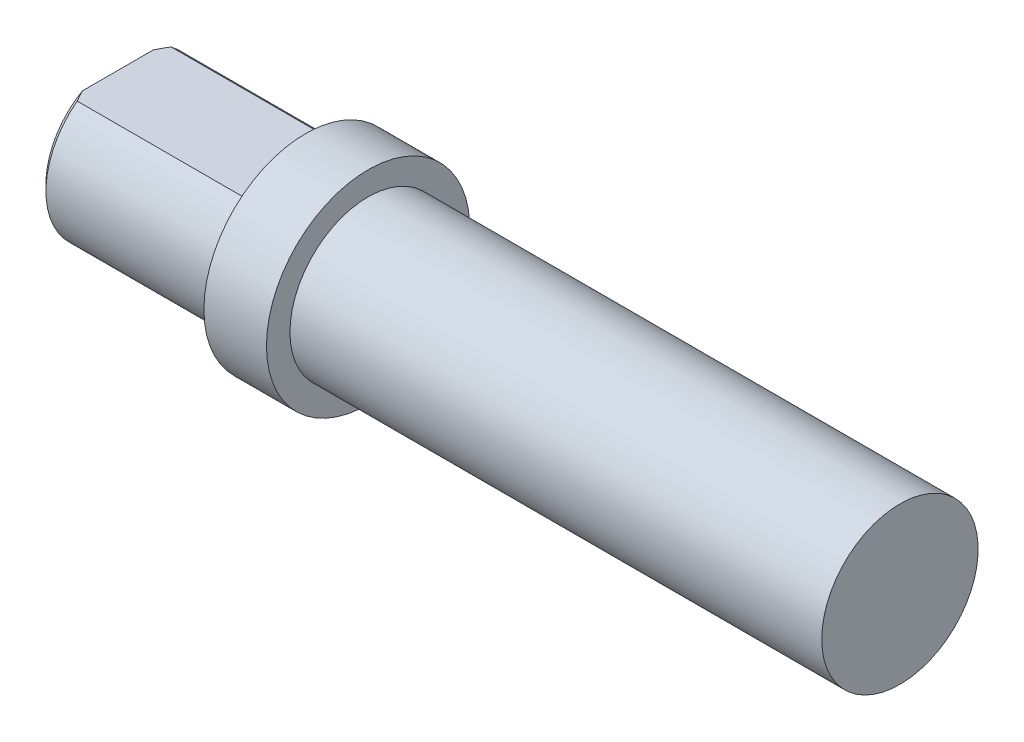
ISO-10303-21;
HEADER;
FILE_DESCRIPTION(('STEP AP214'),'2;1');
FILE_NAME('part.step','',(''),(''),'','','');
FILE_SCHEMA(('AUTOMOTIVE_DESIGN { 1 0 10303 214 1 1 1 1 }'));
ENDSEC;
DATA;
#1=APPLICATION_CONTEXT('core data for automotive mechanical design processes');
#2=APPLICATION_PROTOCOL_DEFINITION('international standard','automotive_design',2000,#1);
#3=PRODUCT_CONTEXT('',#1,'mechanical');
#4=PRODUCT('Part','Part','',(#3));
#5=PRODUCT_RELATED_PRODUCT_CATEGORY('part','',(#4));
#6=PRODUCT_DEFINITION_FORMATION('','',#4);
#7=PRODUCT_DEFINITION_CONTEXT('part definition',#1,'design');
#8=PRODUCT_DEFINITION('design','',#6,#7);
#9=PRODUCT_DEFINITION_SHAPE('','',#8);
#10=(LENGTH_UNIT() NAMED_UNIT(*) SI_UNIT(.MILLI.,.METRE.));
#11=(NAMED_UNIT(*) PLANE_ANGLE_UNIT() SI_UNIT($,.RADIAN.));
#12=(NAMED_UNIT(*) SI_UNIT($,.STERADIAN.) SOLID_ANGLE_UNIT());
#13=UNCERTAINTY_MEASURE_WITH_UNIT(LENGTH_MEASURE(1.E-05),#10,'distance_accuracy_value','');
#14=(GEOMETRIC_REPRESENTATION_CONTEXT(3) GLOBAL_UNCERTAINTY_ASSIGNED_CONTEXT((#13)) GLOBAL_UNIT_ASSIGNED_CONTEXT((#10,
#11,#12)) REPRESENTATION_CONTEXT('',''));
#15=CARTESIAN_POINT('',(0.,0.,0.));
#16=DIRECTION('',(0.,0.,1.));
#17=DIRECTION('',(1.,0.,0.));
#18=AXIS2_PLACEMENT_3D('',#15,#16,#17);
#19=CARTESIAN_POINT('',(0.,0.,0.));
#20=DIRECTION('',(-1.,0.,0.));
#21=DIRECTION('',(0.,0.,1.));
#22=AXIS2_PLACEMENT_3D('',#19,#20,#21);
#23=CYLINDRICAL_SURFACE('',#22,2.5);
#24=CARTESIAN_POINT('',(0.,0.,0.));
#25=DIRECTION('',(-1.,0.,0.));
#26=DIRECTION('',(0.,0.,1.));
#27=AXIS2_PLACEMENT_3D('',#24,#25,#26);
#28=CIRCLE('',#27,2.5);
#29=CARTESIAN_POINT('',(0.,0.,2.5));
#30=VERTEX_POINT('',#29);
#31=EDGE_CURVE('E78',#30,#30,#28,.T.);
#32=ORIENTED_EDGE('',*,*,#31,.T.);
#33=EDGE_LOOP('',(#32));
#34=FACE_BOUND('',#33,.T.);
#35=CARTESIAN_POINT('',(-17.,0.,0.));
#36=DIRECTION('',(-1.,0.,0.));
#37=DIRECTION('',(0.,0.,1.));
#38=AXIS2_PLACEMENT_3D('',#35,#36,#37);
#39=CIRCLE('',#38,2.5);
#40=CARTESIAN_POINT('',(-17.,0.,2.5));
#41=VERTEX_POINT('',#40);
#42=EDGE_CURVE('E83',#41,#41,#39,.T.);
#43=ORIENTED_EDGE('',*,*,#42,.F.);
#44=EDGE_LOOP('',(#43));
#45=FACE_BOUND('',#44,.T.);
#46=ADVANCED_FACE('F33',(#34,#45),#23,.T.);
#47=CARTESIAN_POINT('',(0.,0.,0.));
#48=DIRECTION('',(-1.,0.,0.));
#49=DIRECTION('',(0.,0.,1.));
#50=AXIS2_PLACEMENT_3D('',#47,#48,#49);
#51=PLANE('',#50);
#52=ORIENTED_EDGE('',*,*,#31,.F.);
#53=EDGE_LOOP('',(#52));
#54=FACE_BOUND('',#53,.T.);
#55=ADVANCED_FACE('F113',(#54),#51,.F.);
#56=CARTESIAN_POINT('',(-19.,0.,0.));
#57=DIRECTION('',(-1.,0.,0.));
#58=DIRECTION('',(0.,0.,1.));
#59=AXIS2_PLACEMENT_3D('',#56,#57,#58);
#60=PLANE('',#59);
#61=CARTESIAN_POINT('',(-19.,0.,0.));
#62=DIRECTION('',(-1.,0.,0.));
#63=DIRECTION('',(0.,0.,1.));
#64=AXIS2_PLACEMENT_3D('',#61,#62,#63);
#65=CIRCLE('',#64,3.25);
#66=CARTESIAN_POINT('',(-19.,0.,3.25));
#67=VERTEX_POINT('',#66);
#68=EDGE_CURVE('E72',#67,#67,#65,.T.);
#69=ORIENTED_EDGE('',*,*,#68,.T.);
#70=EDGE_LOOP('',(#69));
#71=FACE_BOUND('',#70,.T.);
#72=CARTESIAN_POINT('',(-19.,0.,0.));
#73=DIRECTION('',(-1.,0.,0.));
#74=DIRECTION('',(0.,0.,1.));
#75=AXIS2_PLACEMENT_3D('',#72,#73,#74);
#76=CIRCLE('',#75,2.5);
#77=CARTESIAN_POINT('',(-19.,2.,-1.5));
#78=VERTEX_POINT('',#77);
#79=CARTESIAN_POINT('',(-19.,2.,1.5));
#80=VERTEX_POINT('',#79);
#81=EDGE_CURVE('E48',#78,#80,#76,.T.);
#82=ORIENTED_EDGE('',*,*,#81,.F.);
#83=DIRECTION('',(0.,0.,-1.));
#84=VECTOR('',#83,1.);
#85=CARTESIAN_POINT('',(-19.,2.,0.));
#86=LINE('',#85,#84);
#87=EDGE_CURVE('E11',#80,#78,#86,.T.);
#88=ORIENTED_EDGE('',*,*,#87,.F.);
#89=EDGE_LOOP('',(#82,#88));
#90=FACE_BOUND('',#89,.T.);
#91=ADVANCED_FACE('F65',(#71,#90),#60,.T.);
#92=CARTESIAN_POINT('',(-17.,0.,0.));
#93=DIRECTION('',(-1.,0.,0.));
#94=DIRECTION('',(0.,0.,1.));
#95=AXIS2_PLACEMENT_3D('',#92,#93,#94);
#96=PLANE('',#95);
#97=CARTESIAN_POINT('',(-17.,0.,0.));
#98=DIRECTION('',(-1.,0.,0.));
#99=DIRECTION('',(0.,0.,1.));
#100=AXIS2_PLACEMENT_3D('',#97,#98,#99);
#101=CIRCLE('',#100,3.25);
#102=CARTESIAN_POINT('',(-17.,0.,3.25));
#103=VERTEX_POINT('',#102);
#104=EDGE_CURVE('E131',#103,#103,#101,.T.);
#105=ORIENTED_EDGE('',*,*,#104,.F.);
#106=EDGE_LOOP('',(#105));
#107=FACE_BOUND('',#106,.T.);
#108=ORIENTED_EDGE('',*,*,#42,.T.);
#109=EDGE_LOOP('',(#108));
#110=FACE_BOUND('',#109,.T.);
#111=ADVANCED_FACE('F120',(#107,#110),#96,.F.);
#112=CARTESIAN_POINT('',(-19.,0.,0.));
#113=DIRECTION('',(1.,0.,0.));
#114=DIRECTION('',(0.,0.,-1.));
#115=AXIS2_PLACEMENT_3D('',#112,#113,#114);
#116=CYLINDRICAL_SURFACE('',#115,3.25);
#117=ORIENTED_EDGE('',*,*,#68,.F.);
#118=EDGE_LOOP('',(#117));
#119=FACE_BOUND('',#118,.T.);
#120=ORIENTED_EDGE('',*,*,#104,.T.);
#121=EDGE_LOOP('',(#120));
#122=FACE_BOUND('',#121,.T.);
#123=ADVANCED_FACE('F105',(#119,#122),#116,.T.);
#124=CARTESIAN_POINT('',(-25.,2.5,0.));
#125=DIRECTION('',(1.,0.,0.));
#126=DIRECTION('',(0.,0.,-1.));
#127=AXIS2_PLACEMENT_3D('',#124,#125,#126);
#128=PLANE('',#127);
#129=DIRECTION('',(0.,0.,1.));
#130=VECTOR('',#129,1.);
#131=CARTESIAN_POINT('',(-25.,2.,0.));
#132=LINE('',#131,#130);
#133=CARTESIAN_POINT('',(-25.,2.,-1.13578166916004));
#134=VERTEX_POINT('',#133);
#135=CARTESIAN_POINT('',(-25.,2.,1.13578166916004));
#136=VERTEX_POINT('',#135);
#137=EDGE_CURVE('E71',#134,#136,#132,.T.);
#138=ORIENTED_EDGE('',*,*,#137,.F.);
#139=CARTESIAN_POINT('',(-25.,0.,0.));
#140=DIRECTION('',(1.,0.,0.));
#141=DIRECTION('',(0.,0.,-1.));
#142=AXIS2_PLACEMENT_3D('',#139,#140,#141);
#143=CIRCLE('',#142,2.29999999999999);
#144=EDGE_CURVE('E81',#134,#136,#143,.F.);
#145=ORIENTED_EDGE('',*,*,#144,.T.);
#146=EDGE_LOOP('',(#138,#145));
#147=FACE_BOUND('',#146,.T.);
#148=ADVANCED_FACE('F107',(#147),#128,.F.);
#149=CARTESIAN_POINT('',(-25.,0.,0.));
#150=DIRECTION('',(1.,0.,0.));
#151=DIRECTION('',(0.,0.,-1.));
#152=AXIS2_PLACEMENT_3D('',#149,#150,#151);
#153=CONICAL_SURFACE('',#152,2.29999999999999,0.785398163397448);
#154=CARTESIAN_POINT('',(-24.8,2.,-1.5));
#155=CARTESIAN_POINT('',(-24.8178220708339,2.,-1.47029456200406));
#156=CARTESIAN_POINT('',(-24.8353973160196,2.,-1.4404397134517));
#157=CARTESIAN_POINT('',(-24.8699864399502,2.,-1.380423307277));
#158=CARTESIAN_POINT('',(-24.8870005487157,2.,-1.35026188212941));
#159=CARTESIAN_POINT('',(-24.920415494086,2.,-1.28959814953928));
#160=CARTESIAN_POINT('',(-24.9368162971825,2.,-1.2590958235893));
#161=CARTESIAN_POINT('',(-24.9689381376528,2.,-1.19771947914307));
#162=CARTESIAN_POINT('',(-24.9846588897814,2.,-1.16684531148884));
#163=CARTESIAN_POINT('',(-25.,2.,-1.13578166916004));
#164=B_SPLINE_CURVE_WITH_KNOTS('',3,(#154,#155,#156,#157,#158,#159,#160,#161,#162,#163),
.UNSPECIFIED.,.F.,.F.,(4,2,2,2,4),(0.,0.103925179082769,0.207807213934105,0.311694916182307,
0.415625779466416),.UNSPECIFIED.);
#165=CARTESIAN_POINT('',(-24.8,2.,-1.5));
#166=VERTEX_POINT('',#165);
#167=EDGE_CURVE('E90',#166,#134,#164,.T.);
#168=ORIENTED_EDGE('',*,*,#167,.F.);
#169=CARTESIAN_POINT('',(-24.8,0.,0.));
#170=DIRECTION('',(1.,0.,0.));
#171=DIRECTION('',(0.,0.,-1.));
#172=AXIS2_PLACEMENT_3D('',#169,#170,#171);
#173=CIRCLE('',#172,2.5);
#174=CARTESIAN_POINT('',(-24.8,2.,1.5));
#175=VERTEX_POINT('',#174);
#176=EDGE_CURVE('E42',#175,#166,#173,.T.);
#177=ORIENTED_EDGE('',*,*,#176,.F.);
#178=CARTESIAN_POINT('',(-25.,2.,1.13578166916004));
#179=CARTESIAN_POINT('',(-24.9846588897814,2.,1.16684531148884));
#180=CARTESIAN_POINT('',(-24.9689381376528,2.,1.19771947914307));
#181=CARTESIAN_POINT('',(-24.9368162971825,2.,1.2590958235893));
#182=CARTESIAN_POINT('',(-24.920415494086,2.,1.28959814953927));
#183=CARTESIAN_POINT('',(-24.8870005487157,2.,1.35026188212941));
#184=CARTESIAN_POINT('',(-24.8699864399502,2.,1.380423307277));
#185=CARTESIAN_POINT('',(-24.8353973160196,2.,1.4404397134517));
#186=CARTESIAN_POINT('',(-24.8178220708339,2.,1.47029456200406));
#187=CARTESIAN_POINT('',(-24.8,2.,1.5));
#188=B_SPLINE_CURVE_WITH_KNOTS('',3,(#178,#179,#180,#181,#182,#183,#184,#185,#186,#187),
.UNSPECIFIED.,.F.,.F.,(4,2,2,2,4),(0.,0.103930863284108,0.20781856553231,0.311700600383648,
0.415625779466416),.UNSPECIFIED.);
#189=EDGE_CURVE('E76',#136,#175,#188,.T.);
#190=ORIENTED_EDGE('',*,*,#189,.F.);
#191=ORIENTED_EDGE('',*,*,#144,.F.);
#192=EDGE_LOOP('',(#168,#177,#190,#191));
#193=FACE_BOUND('',#192,.T.);
#194=ADVANCED_FACE('F35',(#193),#153,.T.);
#195=CARTESIAN_POINT('',(-17.,2.,0.));
#196=DIRECTION('',(0.,-1.,0.));
#197=DIRECTION('',(0.,0.,-1.));
#198=AXIS2_PLACEMENT_3D('',#195,#196,#197);
#199=PLANE('',#198);
#200=DIRECTION('',(-1.,0.,0.));
#201=VECTOR('',#200,1.);
#202=CARTESIAN_POINT('',(-17.,2.,1.5));
#203=LINE('',#202,#201);
#204=EDGE_CURVE('E69',#80,#175,#203,.T.);
#205=ORIENTED_EDGE('',*,*,#204,.F.);
#206=ORIENTED_EDGE('',*,*,#87,.T.);
#207=DIRECTION('',(-1.,0.,0.));
#208=VECTOR('',#207,1.);
#209=CARTESIAN_POINT('',(-17.,2.,-1.5));
#210=LINE('',#209,#208);
#211=EDGE_CURVE('E54',#78,#166,#210,.T.);
#212=ORIENTED_EDGE('',*,*,#211,.T.);
#213=ORIENTED_EDGE('',*,*,#167,.T.);
#214=ORIENTED_EDGE('',*,*,#137,.T.);
#215=ORIENTED_EDGE('',*,*,#189,.T.);
#216=EDGE_LOOP('',(#205,#206,#212,#213,#214,#215));
#217=FACE_BOUND('',#216,.T.);
#218=ADVANCED_FACE('F74',(#217),#199,.F.);
#219=ORIENTED_EDGE('',*,*,#211,.F.);
#220=ORIENTED_EDGE('',*,*,#81,.T.);
#221=ORIENTED_EDGE('',*,*,#204,.T.);
#222=ORIENTED_EDGE('',*,*,#176,.T.);
#223=EDGE_LOOP('',(#219,#220,#221,#222));
#224=FACE_BOUND('',#223,.T.);
#225=ADVANCED_FACE('F68',(#224),#23,.T.);
#226=CLOSED_SHELL('',(#46,#55,#91,#111,#123,#148,#194,#218,#225));
#227=MANIFOLD_SOLID_BREP('B2',#226);
#228=ADVANCED_BREP_SHAPE_REPRESENTATION('',(#18,#227),#14);
#229=SHAPE_DEFINITION_REPRESENTATION(#9,#228);
ENDSEC;
END-ISO-10303-21;
